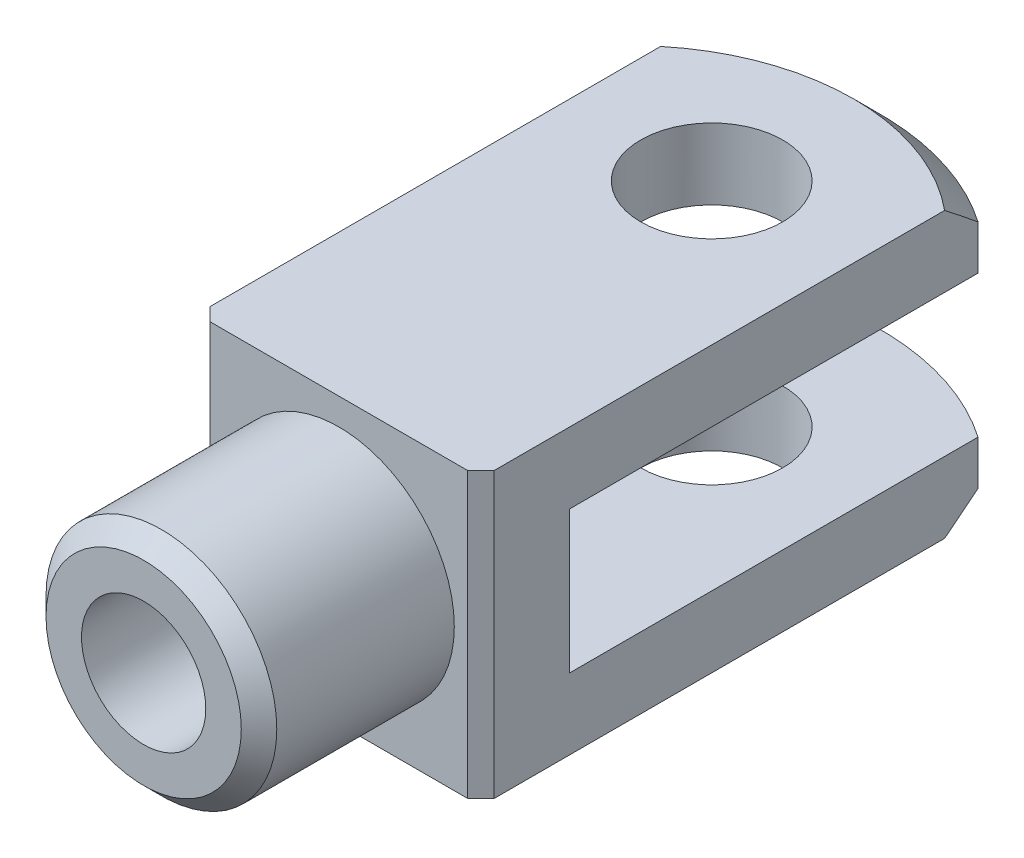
ISO-10303-21;
HEADER;
FILE_DESCRIPTION(('STEP AP214'),'2;1');
FILE_NAME('part.step','',(''),(''),'','','');
FILE_SCHEMA(('AUTOMOTIVE_DESIGN { 1 0 10303 214 1 1 1 1 }'));
ENDSEC;
DATA;
#1=APPLICATION_CONTEXT('core data for automotive mechanical design processes');
#2=APPLICATION_PROTOCOL_DEFINITION('international standard','automotive_design',2000,#1);
#3=PRODUCT_CONTEXT('',#1,'mechanical');
#4=PRODUCT('Part','Part','',(#3));
#5=PRODUCT_RELATED_PRODUCT_CATEGORY('part','',(#4));
#6=PRODUCT_DEFINITION_FORMATION('','',#4);
#7=PRODUCT_DEFINITION_CONTEXT('part definition',#1,'design');
#8=PRODUCT_DEFINITION('design','',#6,#7);
#9=PRODUCT_DEFINITION_SHAPE('','',#8);
#10=(LENGTH_UNIT() NAMED_UNIT(*) SI_UNIT(.MILLI.,.METRE.));
#11=(NAMED_UNIT(*) PLANE_ANGLE_UNIT() SI_UNIT($,.RADIAN.));
#12=(NAMED_UNIT(*) SI_UNIT($,.STERADIAN.) SOLID_ANGLE_UNIT());
#13=UNCERTAINTY_MEASURE_WITH_UNIT(LENGTH_MEASURE(1.E-05),#10,'distance_accuracy_value','');
#14=(GEOMETRIC_REPRESENTATION_CONTEXT(3) GLOBAL_UNCERTAINTY_ASSIGNED_CONTEXT((#13)) GLOBAL_UNIT_ASSIGNED_CONTEXT((#10,
#11,#12)) REPRESENTATION_CONTEXT('',''));
#15=CARTESIAN_POINT('',(0.,0.,0.));
#16=DIRECTION('',(0.,0.,1.));
#17=DIRECTION('',(1.,0.,0.));
#18=AXIS2_PLACEMENT_3D('',#15,#16,#17);
#19=CARTESIAN_POINT('',(-16.,16.,83.));
#20=DIRECTION('',(1.,0.,0.));
#21=DIRECTION('',(0.,1.,0.));
#22=AXIS2_PLACEMENT_3D('',#19,#20,#21);
#23=PLANE('',#22);
#24=DIRECTION('',(0.,0.,-1.));
#25=VECTOR('',#24,1.);
#26=CARTESIAN_POINT('',(-16.,-16.,83.));
#27=LINE('',#26,#25);
#28=CARTESIAN_POINT('',(-16.,-16.,59.5));
#29=VERTEX_POINT('',#28);
#30=CARTESIAN_POINT('',(-16.,-16.,8.76066185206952));
#31=VERTEX_POINT('',#30);
#32=EDGE_CURVE('E158',#29,#31,#27,.T.);
#33=ORIENTED_EDGE('',*,*,#32,.F.);
#34=DIRECTION('',(0.,1.,0.));
#35=VECTOR('',#34,1.);
#36=CARTESIAN_POINT('',(-16.,16.,59.5));
#37=LINE('',#36,#35);
#38=CARTESIAN_POINT('',(-16.,16.,59.5));
#39=VERTEX_POINT('',#38);
#40=EDGE_CURVE('E53',#29,#39,#37,.T.);
#41=ORIENTED_EDGE('',*,*,#40,.T.);
#42=DIRECTION('',(0.,0.,-1.));
#43=VECTOR('',#42,1.);
#44=CARTESIAN_POINT('',(-16.,16.,83.));
#45=LINE('',#44,#43);
#46=CARTESIAN_POINT('',(-16.,16.,8.76066185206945));
#47=VERTEX_POINT('',#46);
#48=EDGE_CURVE('E147',#39,#47,#45,.T.);
#49=ORIENTED_EDGE('',*,*,#48,.T.);
#50=CARTESIAN_POINT('',(-16.,16.,8.76066185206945));
#51=CARTESIAN_POINT('',(-16.,15.7552947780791,8.44307997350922));
#52=CARTESIAN_POINT('',(-16.,15.509068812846,8.12667417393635));
#53=CARTESIAN_POINT('',(-16.,15.013890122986,7.49603447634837));
#54=CARTESIAN_POINT('',(-16.,14.7649375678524,7.18180044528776));
#55=CARTESIAN_POINT('',(-16.,14.2645926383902,6.55528799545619));
#56=CARTESIAN_POINT('',(-16.,14.0132002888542,6.24300955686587));
#57=CARTESIAN_POINT('',(-16.,13.5081987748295,5.62021788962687));
#58=CARTESIAN_POINT('',(-16.,13.2545894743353,5.30970477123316));
#59=CARTESIAN_POINT('',(-16.,13.0000000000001,5.));
#60=B_SPLINE_CURVE_WITH_KNOTS('',3,(#50,#51,#52,#53,#54,#55,#56,#57,#58,#59),.UNSPECIFIED.,.F.,
.F.,(4,2,2,2,4),(0.,1.20275814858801,2.40544194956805,3.60811354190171,4.81085944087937),.UNSPECIFIED.);
#61=CARTESIAN_POINT('',(-16.,13.,5.00000000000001));
#62=VERTEX_POINT('',#61);
#63=EDGE_CURVE('E124',#47,#62,#60,.T.);
#64=ORIENTED_EDGE('',*,*,#63,.T.);
#65=DIRECTION('',(0.,-1.,0.));
#66=VECTOR('',#65,1.);
#67=CARTESIAN_POINT('',(-16.,134.169634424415,5.00000000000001));
#68=LINE('',#67,#66);
#69=CARTESIAN_POINT('',(-16.,8.00000000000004,5.00000000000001));
#70=VERTEX_POINT('',#69);
#71=EDGE_CURVE('E117',#62,#70,#68,.T.);
#72=ORIENTED_EDGE('',*,*,#71,.T.);
#73=DIRECTION('',(0.,0.,1.));
#74=VECTOR('',#73,1.);
#75=CARTESIAN_POINT('',(-16.,8.00000000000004,83.));
#76=LINE('',#75,#74);
#77=CARTESIAN_POINT('',(-16.,8.00000000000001,51.));
#78=VERTEX_POINT('',#77);
#79=EDGE_CURVE('E121',#70,#78,#76,.T.);
#80=ORIENTED_EDGE('',*,*,#79,.T.);
#81=DIRECTION('',(0.,-1.,0.));
#82=VECTOR('',#81,1.);
#83=CARTESIAN_POINT('',(-16.,16.,51.));
#84=LINE('',#83,#82);
#85=CARTESIAN_POINT('',(-16.,-8.00000000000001,51.));
#86=VERTEX_POINT('',#85);
#87=EDGE_CURVE('E144',#78,#86,#84,.T.);
#88=ORIENTED_EDGE('',*,*,#87,.T.);
#89=DIRECTION('',(0.,0.,-1.));
#90=VECTOR('',#89,1.);
#91=CARTESIAN_POINT('',(-16.,-7.99999999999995,83.));
#92=LINE('',#91,#90);
#93=CARTESIAN_POINT('',(-16.,-8.00000000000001,5.00000000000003));
#94=VERTEX_POINT('',#93);
#95=EDGE_CURVE('E145',#86,#94,#92,.T.);
#96=ORIENTED_EDGE('',*,*,#95,.T.);
#97=CARTESIAN_POINT('',(-16.,-13.,5.00000000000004));
#98=VERTEX_POINT('',#97);
#99=EDGE_CURVE('E129',#94,#98,#68,.T.);
#100=ORIENTED_EDGE('',*,*,#99,.T.);
#101=CARTESIAN_POINT('',(-16.,-13.,5.00000000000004));
#102=CARTESIAN_POINT('',(-16.,-13.2545894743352,5.30970477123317));
#103=CARTESIAN_POINT('',(-16.,-13.5081987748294,5.62021788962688));
#104=CARTESIAN_POINT('',(-16.,-14.0132002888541,6.24300955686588));
#105=CARTESIAN_POINT('',(-16.,-14.2645926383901,6.55528799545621));
#106=CARTESIAN_POINT('',(-16.,-14.7649375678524,7.18180044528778));
#107=CARTESIAN_POINT('',(-16.,-15.013890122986,7.4960344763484));
#108=CARTESIAN_POINT('',(-16.,-15.509068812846,8.12667417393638));
#109=CARTESIAN_POINT('',(-16.,-15.755294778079,8.44307997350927));
#110=CARTESIAN_POINT('',(-16.,-16.,8.76066185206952));
#111=B_SPLINE_CURVE_WITH_KNOTS('',3,(#101,#102,#103,#104,#105,#106,#107,#108,#109,#110),
.UNSPECIFIED.,.F.,.F.,(4,2,2,2,4),(0.,1.20274589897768,2.40541749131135,3.6081012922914,
4.81085944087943),.UNSPECIFIED.);
#112=EDGE_CURVE('E259',#98,#31,#111,.T.);
#113=ORIENTED_EDGE('',*,*,#112,.T.);
#114=EDGE_LOOP('',(#33,#41,#49,#64,#72,#80,#88,#96,#100,#113));
#115=FACE_BOUND('',#114,.T.);
#116=ADVANCED_FACE('F30',(#115),#23,.F.);
#117=CARTESIAN_POINT('',(-16.,-16.,83.));
#118=DIRECTION('',(0.,1.,0.));
#119=DIRECTION('',(0.,0.,1.));
#120=AXIS2_PLACEMENT_3D('',#117,#118,#119);
#121=PLANE('',#120);
#122=CARTESIAN_POINT('',(0.,-16.,19.));
#123=DIRECTION('',(0.,1.,0.));
#124=DIRECTION('',(0.,0.,1.));
#125=AXIS2_PLACEMENT_3D('',#122,#123,#124);
#126=CIRCLE('',#125,8.);
#127=CARTESIAN_POINT('',(0.,-16.,27.));
#128=VERTEX_POINT('',#127);
#129=EDGE_CURVE('E215',#128,#128,#126,.T.);
#130=ORIENTED_EDGE('',*,*,#129,.T.);
#131=EDGE_LOOP('',(#130));
#132=FACE_BOUND('',#131,.T.);
#133=DIRECTION('',(1.,0.,0.));
#134=VECTOR('',#133,1.);
#135=CARTESIAN_POINT('',(-16.,-16.,61.));
#136=LINE('',#135,#134);
#137=CARTESIAN_POINT('',(-14.5,-16.,61.));
#138=VERTEX_POINT('',#137);
#139=CARTESIAN_POINT('',(14.5,-16.,61.));
#140=VERTEX_POINT('',#139);
#141=EDGE_CURVE('E218',#138,#140,#136,.T.);
#142=ORIENTED_EDGE('',*,*,#141,.F.);
#143=DIRECTION('',(-0.707106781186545,0.,-0.70710678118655));
#144=VECTOR('',#143,1.);
#145=CARTESIAN_POINT('',(-14.5,-16.,61.));
#146=LINE('',#145,#144);
#147=EDGE_CURVE('E219',#138,#29,#146,.T.);
#148=ORIENTED_EDGE('',*,*,#147,.T.);
#149=ORIENTED_EDGE('',*,*,#32,.T.);
#150=CARTESIAN_POINT('',(0.,-16.,28.1));
#151=DIRECTION('',(0.,1.,0.));
#152=DIRECTION('',(0.,0.,1.));
#153=AXIS2_PLACEMENT_3D('',#150,#151,#152);
#154=CIRCLE('',#153,25.1);
#155=CARTESIAN_POINT('',(16.,-16.,8.76066185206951));
#156=VERTEX_POINT('',#155);
#157=EDGE_CURVE('E334',#31,#156,#154,.F.);
#158=ORIENTED_EDGE('',*,*,#157,.T.);
#159=DIRECTION('',(0.,0.,-1.));
#160=VECTOR('',#159,1.);
#161=CARTESIAN_POINT('',(16.,-16.,83.));
#162=LINE('',#161,#160);
#163=CARTESIAN_POINT('',(16.,-16.,59.5));
#164=VERTEX_POINT('',#163);
#165=EDGE_CURVE('E156',#164,#156,#162,.T.);
#166=ORIENTED_EDGE('',*,*,#165,.F.);
#167=DIRECTION('',(-0.707106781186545,0.,0.70710678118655));
#168=VECTOR('',#167,1.);
#169=CARTESIAN_POINT('',(14.5,-16.,61.));
#170=LINE('',#169,#168);
#171=EDGE_CURVE('E222',#164,#140,#170,.T.);
#172=ORIENTED_EDGE('',*,*,#171,.T.);
#173=EDGE_LOOP('',(#142,#148,#149,#158,#166,#172));
#174=FACE_BOUND('',#173,.T.);
#175=ADVANCED_FACE('F203',(#132,#174),#121,.F.);
#176=CARTESIAN_POINT('',(16.,16.,83.));
#177=DIRECTION('',(-1.,0.,0.));
#178=DIRECTION('',(0.,-1.,0.));
#179=AXIS2_PLACEMENT_3D('',#176,#177,#178);
#180=PLANE('',#179);
#181=DIRECTION('',(0.,0.,-1.));
#182=VECTOR('',#181,1.);
#183=CARTESIAN_POINT('',(16.,16.,83.));
#184=LINE('',#183,#182);
#185=CARTESIAN_POINT('',(16.,16.,59.5));
#186=VERTEX_POINT('',#185);
#187=CARTESIAN_POINT('',(16.,16.,8.76066185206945));
#188=VERTEX_POINT('',#187);
#189=EDGE_CURVE('E154',#186,#188,#184,.T.);
#190=ORIENTED_EDGE('',*,*,#189,.F.);
#191=DIRECTION('',(0.,-1.,0.));
#192=VECTOR('',#191,1.);
#193=CARTESIAN_POINT('',(16.,-16.,59.5));
#194=LINE('',#193,#192);
#195=EDGE_CURVE('E11',#186,#164,#194,.T.);
#196=ORIENTED_EDGE('',*,*,#195,.T.);
#197=ORIENTED_EDGE('',*,*,#165,.T.);
#198=CARTESIAN_POINT('',(16.,-16.,8.76066185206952));
#199=CARTESIAN_POINT('',(16.,-15.7552947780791,8.44307997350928));
#200=CARTESIAN_POINT('',(16.,-15.509068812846,8.1266741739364));
#201=CARTESIAN_POINT('',(16.,-15.013890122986,7.49603447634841));
#202=CARTESIAN_POINT('',(16.,-14.7649375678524,7.1818004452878));
#203=CARTESIAN_POINT('',(16.,-14.2645926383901,6.55528799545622));
#204=CARTESIAN_POINT('',(16.,-14.0132002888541,6.24300955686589));
#205=CARTESIAN_POINT('',(16.,-13.5081987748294,5.6202178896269));
#206=CARTESIAN_POINT('',(16.,-13.2545894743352,5.30970477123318));
#207=CARTESIAN_POINT('',(16.,-13.,5.00000000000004));
#208=B_SPLINE_CURVE_WITH_KNOTS('',3,(#198,#199,#200,#201,#202,#203,#204,#205,#206,#207),
.UNSPECIFIED.,.F.,.F.,(4,2,2,2,4),(0.,1.20275814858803,2.40544194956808,3.60811354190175,
4.81085944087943),.UNSPECIFIED.);
#209=CARTESIAN_POINT('',(16.,-13.,5.00000000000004));
#210=VERTEX_POINT('',#209);
#211=EDGE_CURVE('E182',#156,#210,#208,.T.);
#212=ORIENTED_EDGE('',*,*,#211,.T.);
#213=DIRECTION('',(0.,-1.,0.));
#214=VECTOR('',#213,1.);
#215=CARTESIAN_POINT('',(16.,134.169634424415,5.));
#216=LINE('',#215,#214);
#217=CARTESIAN_POINT('',(16.,-7.99999999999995,5.00000000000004));
#218=VERTEX_POINT('',#217);
#219=EDGE_CURVE('E128',#218,#210,#216,.T.);
#220=ORIENTED_EDGE('',*,*,#219,.F.);
#221=DIRECTION('',(0.,0.,-1.));
#222=VECTOR('',#221,1.);
#223=CARTESIAN_POINT('',(16.,-8.00000000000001,51.));
#224=LINE('',#223,#222);
#225=CARTESIAN_POINT('',(16.,-8.00000000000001,51.));
#226=VERTEX_POINT('',#225);
#227=EDGE_CURVE('E231',#226,#218,#224,.T.);
#228=ORIENTED_EDGE('',*,*,#227,.F.);
#229=DIRECTION('',(0.,-1.,0.));
#230=VECTOR('',#229,1.);
#231=CARTESIAN_POINT('',(16.,-8.00000000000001,51.));
#232=LINE('',#231,#230);
#233=CARTESIAN_POINT('',(16.,8.00000000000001,51.));
#234=VERTEX_POINT('',#233);
#235=EDGE_CURVE('E227',#234,#226,#232,.T.);
#236=ORIENTED_EDGE('',*,*,#235,.F.);
#237=DIRECTION('',(0.,0.,1.));
#238=VECTOR('',#237,1.);
#239=CARTESIAN_POINT('',(16.,8.00000000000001,51.));
#240=LINE('',#239,#238);
#241=CARTESIAN_POINT('',(16.,7.99999999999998,5.));
#242=VERTEX_POINT('',#241);
#243=EDGE_CURVE('E238',#242,#234,#240,.T.);
#244=ORIENTED_EDGE('',*,*,#243,.F.);
#245=CARTESIAN_POINT('',(16.,13.,5.));
#246=VERTEX_POINT('',#245);
#247=EDGE_CURVE('E135',#246,#242,#216,.T.);
#248=ORIENTED_EDGE('',*,*,#247,.F.);
#249=CARTESIAN_POINT('',(16.,13.,5.));
#250=CARTESIAN_POINT('',(16.,13.2545894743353,5.30970477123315));
#251=CARTESIAN_POINT('',(16.,13.5081987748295,5.62021788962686));
#252=CARTESIAN_POINT('',(16.,14.0132002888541,6.24300955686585));
#253=CARTESIAN_POINT('',(16.,14.2645926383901,6.55528799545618));
#254=CARTESIAN_POINT('',(16.,14.7649375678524,7.18180044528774));
#255=CARTESIAN_POINT('',(16.,15.013890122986,7.49603447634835));
#256=CARTESIAN_POINT('',(16.,15.509068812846,8.12667417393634));
#257=CARTESIAN_POINT('',(16.,15.755294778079,8.44307997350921));
#258=CARTESIAN_POINT('',(16.,16.,8.76066185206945));
#259=B_SPLINE_CURVE_WITH_KNOTS('',3,(#249,#250,#251,#252,#253,#254,#255,#256,#257,#258),
.UNSPECIFIED.,.F.,.F.,(4,2,2,2,4),(0.,1.20274589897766,2.40541749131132,3.60810129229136,
4.81085944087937),.UNSPECIFIED.);
#260=EDGE_CURVE('E189',#246,#188,#259,.T.);
#261=ORIENTED_EDGE('',*,*,#260,.T.);
#262=EDGE_LOOP('',(#190,#196,#197,#212,#220,#228,#236,#244,#248,#261));
#263=FACE_BOUND('',#262,.T.);
#264=ADVANCED_FACE('F198',(#263),#180,.F.);
#265=CARTESIAN_POINT('',(-16.,16.,83.));
#266=DIRECTION('',(0.,-1.,0.));
#267=DIRECTION('',(0.,0.,-1.));
#268=AXIS2_PLACEMENT_3D('',#265,#266,#267);
#269=PLANE('',#268);
#270=CARTESIAN_POINT('',(0.,16.,19.));
#271=DIRECTION('',(0.,1.,0.));
#272=DIRECTION('',(0.,0.,1.));
#273=AXIS2_PLACEMENT_3D('',#270,#271,#272);
#274=CIRCLE('',#273,8.);
#275=CARTESIAN_POINT('',(0.,16.,27.));
#276=VERTEX_POINT('',#275);
#277=EDGE_CURVE('E168',#276,#276,#274,.T.);
#278=ORIENTED_EDGE('',*,*,#277,.F.);
#279=EDGE_LOOP('',(#278));
#280=FACE_BOUND('',#279,.T.);
#281=ORIENTED_EDGE('',*,*,#48,.F.);
#282=DIRECTION('',(0.707106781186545,0.,0.70710678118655));
#283=VECTOR('',#282,1.);
#284=CARTESIAN_POINT('',(-14.5,16.,61.));
#285=LINE('',#284,#283);
#286=CARTESIAN_POINT('',(-14.5,16.,61.));
#287=VERTEX_POINT('',#286);
#288=EDGE_CURVE('E38',#39,#287,#285,.T.);
#289=ORIENTED_EDGE('',*,*,#288,.T.);
#290=DIRECTION('',(-1.,0.,0.));
#291=VECTOR('',#290,1.);
#292=CARTESIAN_POINT('',(-16.,16.,61.));
#293=LINE('',#292,#291);
#294=CARTESIAN_POINT('',(14.5,16.,61.));
#295=VERTEX_POINT('',#294);
#296=EDGE_CURVE('E160',#295,#287,#293,.T.);
#297=ORIENTED_EDGE('',*,*,#296,.F.);
#298=DIRECTION('',(0.707106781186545,0.,-0.70710678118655));
#299=VECTOR('',#298,1.);
#300=CARTESIAN_POINT('',(14.5,16.,61.));
#301=LINE('',#300,#299);
#302=EDGE_CURVE('E45',#295,#186,#301,.T.);
#303=ORIENTED_EDGE('',*,*,#302,.T.);
#304=ORIENTED_EDGE('',*,*,#189,.T.);
#305=CARTESIAN_POINT('',(0.,16.,28.1));
#306=DIRECTION('',(0.,-1.,0.));
#307=DIRECTION('',(0.,0.,-1.));
#308=AXIS2_PLACEMENT_3D('',#305,#306,#307);
#309=CIRCLE('',#308,25.1);
#310=EDGE_CURVE('E360',#188,#47,#309,.F.);
#311=ORIENTED_EDGE('',*,*,#310,.T.);
#312=EDGE_LOOP('',(#281,#289,#297,#303,#304,#311));
#313=FACE_BOUND('',#312,.T.);
#314=ADVANCED_FACE('F202',(#280,#313),#269,.F.);
#315=CARTESIAN_POINT('',(-38.,7.99999999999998,51.));
#316=DIRECTION('',(0.,1.,0.));
#317=DIRECTION('',(-1.,0.,0.));
#318=AXIS2_PLACEMENT_3D('',#315,#316,#317);
#319=PLANE('',#318);
#320=CARTESIAN_POINT('',(0.,8.00000000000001,19.));
#321=DIRECTION('',(0.,1.,0.));
#322=DIRECTION('',(-1.,0.,0.));
#323=AXIS2_PLACEMENT_3D('',#320,#321,#322);
#324=CIRCLE('',#323,8.);
#325=CARTESIAN_POINT('',(-8.,8.00000000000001,19.));
#326=VERTEX_POINT('',#325);
#327=EDGE_CURVE('E167',#326,#326,#324,.T.);
#328=ORIENTED_EDGE('',*,*,#327,.T.);
#329=EDGE_LOOP('',(#328));
#330=FACE_BOUND('',#329,.T.);
#331=CARTESIAN_POINT('',(0.,7.99999999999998,28.1));
#332=DIRECTION('',(0.,1.,0.));
#333=DIRECTION('',(-1.,0.,0.));
#334=AXIS2_PLACEMENT_3D('',#331,#332,#333);
#335=CIRCLE('',#334,28.1);
#336=EDGE_CURVE('E132',#242,#70,#335,.T.);
#337=ORIENTED_EDGE('',*,*,#336,.F.);
#338=ORIENTED_EDGE('',*,*,#243,.T.);
#339=DIRECTION('',(1.,0.,0.));
#340=VECTOR('',#339,1.);
#341=CARTESIAN_POINT('',(-38.,7.99999999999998,51.));
#342=LINE('',#341,#340);
#343=EDGE_CURVE('E143',#78,#234,#342,.T.);
#344=ORIENTED_EDGE('',*,*,#343,.F.);
#345=ORIENTED_EDGE('',*,*,#79,.F.);
#346=EDGE_LOOP('',(#337,#338,#344,#345));
#347=FACE_BOUND('',#346,.T.);
#348=ADVANCED_FACE('F141',(#330,#347),#319,.F.);
#349=CARTESIAN_POINT('',(-38.,-8.00000000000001,51.));
#350=DIRECTION('',(0.,-1.,0.));
#351=DIRECTION('',(1.,0.,0.));
#352=AXIS2_PLACEMENT_3D('',#349,#350,#351);
#353=PLANE('',#352);
#354=CARTESIAN_POINT('',(0.,-8.00000000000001,19.));
#355=DIRECTION('',(0.,-1.,0.));
#356=DIRECTION('',(1.,0.,0.));
#357=AXIS2_PLACEMENT_3D('',#354,#355,#356);
#358=CIRCLE('',#357,8.);
#359=CARTESIAN_POINT('',(8.,-8.00000000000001,19.));
#360=VERTEX_POINT('',#359);
#361=EDGE_CURVE('E164',#360,#360,#358,.T.);
#362=ORIENTED_EDGE('',*,*,#361,.T.);
#363=EDGE_LOOP('',(#362));
#364=FACE_BOUND('',#363,.T.);
#365=CARTESIAN_POINT('',(0.,-8.00000000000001,28.1));
#366=DIRECTION('',(0.,-1.,0.));
#367=DIRECTION('',(1.,0.,0.));
#368=AXIS2_PLACEMENT_3D('',#365,#366,#367);
#369=CIRCLE('',#368,28.1);
#370=EDGE_CURVE('E174',#94,#218,#369,.T.);
#371=ORIENTED_EDGE('',*,*,#370,.F.);
#372=ORIENTED_EDGE('',*,*,#95,.F.);
#373=DIRECTION('',(1.,0.,0.));
#374=VECTOR('',#373,1.);
#375=CARTESIAN_POINT('',(-38.,-8.00000000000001,51.));
#376=LINE('',#375,#374);
#377=EDGE_CURVE('E240',#86,#226,#376,.T.);
#378=ORIENTED_EDGE('',*,*,#377,.T.);
#379=ORIENTED_EDGE('',*,*,#227,.T.);
#380=EDGE_LOOP('',(#371,#372,#378,#379));
#381=FACE_BOUND('',#380,.T.);
#382=ADVANCED_FACE('F243',(#364,#381),#353,.F.);
#383=CARTESIAN_POINT('',(-38.,-8.00000000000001,51.));
#384=DIRECTION('',(0.,0.,1.));
#385=DIRECTION('',(1.,0.,0.));
#386=AXIS2_PLACEMENT_3D('',#383,#384,#385);
#387=PLANE('',#386);
#388=CARTESIAN_POINT('',(0.,0.,51.));
#389=DIRECTION('',(0.,0.,1.));
#390=DIRECTION('',(1.,0.,0.));
#391=AXIS2_PLACEMENT_3D('',#388,#389,#390);
#392=CIRCLE('',#391,6.99999999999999);
#393=CARTESIAN_POINT('',(6.99999999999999,0.,51.));
#394=VERTEX_POINT('',#393);
#395=EDGE_CURVE('E175',#394,#394,#392,.T.);
#396=ORIENTED_EDGE('',*,*,#395,.T.);
#397=EDGE_LOOP('',(#396));
#398=FACE_BOUND('',#397,.T.);
#399=ORIENTED_EDGE('',*,*,#343,.T.);
#400=ORIENTED_EDGE('',*,*,#235,.T.);
#401=ORIENTED_EDGE('',*,*,#377,.F.);
#402=ORIENTED_EDGE('',*,*,#87,.F.);
#403=EDGE_LOOP('',(#399,#400,#401,#402));
#404=FACE_BOUND('',#403,.T.);
#405=ADVANCED_FACE('F248',(#398,#404),#387,.F.);
#406=CARTESIAN_POINT('',(0.,0.,61.));
#407=DIRECTION('',(0.,0.,1.));
#408=DIRECTION('',(1.,0.,0.));
#409=AXIS2_PLACEMENT_3D('',#406,#407,#408);
#410=PLANE('',#409);
#411=CARTESIAN_POINT('',(0.,0.,61.));
#412=DIRECTION('',(0.,0.,1.));
#413=DIRECTION('',(1.,0.,0.));
#414=AXIS2_PLACEMENT_3D('',#411,#412,#413);
#415=CIRCLE('',#414,13.);
#416=CARTESIAN_POINT('',(13.,0.,61.));
#417=VERTEX_POINT('',#416);
#418=EDGE_CURVE('E228',#417,#417,#415,.T.);
#419=ORIENTED_EDGE('',*,*,#418,.F.);
#420=EDGE_LOOP('',(#419));
#421=FACE_BOUND('',#420,.T.);
#422=ORIENTED_EDGE('',*,*,#296,.T.);
#423=DIRECTION('',(0.,-1.,0.));
#424=VECTOR('',#423,1.);
#425=CARTESIAN_POINT('',(-14.5,-16.,61.));
#426=LINE('',#425,#424);
#427=EDGE_CURVE('E339',#287,#138,#426,.T.);
#428=ORIENTED_EDGE('',*,*,#427,.T.);
#429=ORIENTED_EDGE('',*,*,#141,.T.);
#430=DIRECTION('',(0.,1.,0.));
#431=VECTOR('',#430,1.);
#432=CARTESIAN_POINT('',(14.5,16.,61.));
#433=LINE('',#432,#431);
#434=EDGE_CURVE('E337',#140,#295,#433,.T.);
#435=ORIENTED_EDGE('',*,*,#434,.T.);
#436=EDGE_LOOP('',(#422,#428,#429,#435));
#437=FACE_BOUND('',#436,.T.);
#438=ADVANCED_FACE('F292',(#421,#437),#410,.T.);
#439=CARTESIAN_POINT('',(0.,0.,61.));
#440=DIRECTION('',(0.,0.,1.));
#441=DIRECTION('',(1.,0.,0.));
#442=AXIS2_PLACEMENT_3D('',#439,#440,#441);
#443=CYLINDRICAL_SURFACE('',#442,13.);
#444=CARTESIAN_POINT('',(0.,0.,81.));
#445=DIRECTION('',(0.,0.,1.));
#446=DIRECTION('',(1.,0.,0.));
#447=AXIS2_PLACEMENT_3D('',#444,#445,#446);
#448=CIRCLE('',#447,13.);
#449=CARTESIAN_POINT('',(13.,0.,81.));
#450=VERTEX_POINT('',#449);
#451=EDGE_CURVE('E171',#450,#450,#448,.F.);
#452=ORIENTED_EDGE('',*,*,#451,.T.);
#453=EDGE_LOOP('',(#452));
#454=FACE_BOUND('',#453,.T.);
#455=ORIENTED_EDGE('',*,*,#418,.T.);
#456=EDGE_LOOP('',(#455));
#457=FACE_BOUND('',#456,.T.);
#458=ADVANCED_FACE('F289',(#454,#457),#443,.T.);
#459=CARTESIAN_POINT('',(-16.,-16.,83.));
#460=DIRECTION('',(0.,0.,1.));
#461=DIRECTION('',(1.,0.,0.));
#462=AXIS2_PLACEMENT_3D('',#459,#460,#461);
#463=PLANE('',#462);
#464=CARTESIAN_POINT('',(0.,0.,83.));
#465=DIRECTION('',(0.,0.,1.));
#466=DIRECTION('',(1.,0.,0.));
#467=AXIS2_PLACEMENT_3D('',#464,#465,#466);
#468=CIRCLE('',#467,7.);
#469=CARTESIAN_POINT('',(6.99999999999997,0.,83.));
#470=VERTEX_POINT('',#469);
#471=EDGE_CURVE('E138',#470,#470,#468,.T.);
#472=ORIENTED_EDGE('',*,*,#471,.F.);
#473=EDGE_LOOP('',(#472));
#474=FACE_BOUND('',#473,.T.);
#475=CARTESIAN_POINT('',(0.,0.,83.));
#476=DIRECTION('',(0.,0.,1.));
#477=DIRECTION('',(1.,0.,0.));
#478=AXIS2_PLACEMENT_3D('',#475,#476,#477);
#479=CIRCLE('',#478,11.);
#480=CARTESIAN_POINT('',(11.,0.,83.));
#481=VERTEX_POINT('',#480);
#482=EDGE_CURVE('E163',#481,#481,#479,.T.);
#483=ORIENTED_EDGE('',*,*,#482,.T.);
#484=EDGE_LOOP('',(#483));
#485=FACE_BOUND('',#484,.T.);
#486=ADVANCED_FACE('F285',(#474,#485),#463,.T.);
#487=CARTESIAN_POINT('',(0.,-34.,19.));
#488=DIRECTION('',(0.,1.,0.));
#489=DIRECTION('',(0.,0.,1.));
#490=AXIS2_PLACEMENT_3D('',#487,#488,#489);
#491=CYLINDRICAL_SURFACE('',#490,8.);
#492=ORIENTED_EDGE('',*,*,#361,.F.);
#493=EDGE_LOOP('',(#492));
#494=FACE_BOUND('',#493,.T.);
#495=ORIENTED_EDGE('',*,*,#129,.F.);
#496=EDGE_LOOP('',(#495));
#497=FACE_BOUND('',#496,.T.);
#498=ADVANCED_FACE('F273',(#494,#497),#491,.F.);
#499=ORIENTED_EDGE('',*,*,#277,.T.);
#500=EDGE_LOOP('',(#499));
#501=FACE_BOUND('',#500,.T.);
#502=ORIENTED_EDGE('',*,*,#327,.F.);
#503=EDGE_LOOP('',(#502));
#504=FACE_BOUND('',#503,.T.);
#505=ADVANCED_FACE('F270',(#501,#504),#491,.F.);
#506=CARTESIAN_POINT('',(0.,0.,83.));
#507=DIRECTION('',(0.,0.,-1.));
#508=DIRECTION('',(-1.,0.,0.));
#509=AXIS2_PLACEMENT_3D('',#506,#507,#508);
#510=CONICAL_SURFACE('',#509,11.,0.785398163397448);
#511=ORIENTED_EDGE('',*,*,#451,.F.);
#512=EDGE_LOOP('',(#511));
#513=FACE_BOUND('',#512,.T.);
#514=ORIENTED_EDGE('',*,*,#482,.F.);
#515=EDGE_LOOP('',(#514));
#516=FACE_BOUND('',#515,.T.);
#517=ADVANCED_FACE('F272',(#513,#516),#510,.T.);
#518=CARTESIAN_POINT('',(0.,0.,83.));
#519=DIRECTION('',(0.,0.,1.));
#520=DIRECTION('',(1.,0.,0.));
#521=AXIS2_PLACEMENT_3D('',#518,#519,#520);
#522=CYLINDRICAL_SURFACE('',#521,6.99999999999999);
#523=ORIENTED_EDGE('',*,*,#471,.T.);
#524=EDGE_LOOP('',(#523));
#525=FACE_BOUND('',#524,.T.);
#526=ORIENTED_EDGE('',*,*,#395,.F.);
#527=EDGE_LOOP('',(#526));
#528=FACE_BOUND('',#527,.T.);
#529=ADVANCED_FACE('F281',(#525,#528),#522,.F.);
#530=CARTESIAN_POINT('',(0.,134.169634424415,28.1));
#531=DIRECTION('',(0.,-1.,0.));
#532=DIRECTION('',(0.,0.,-1.));
#533=AXIS2_PLACEMENT_3D('',#530,#531,#532);
#534=CYLINDRICAL_SURFACE('',#533,28.1);
#535=ORIENTED_EDGE('',*,*,#219,.T.);
#536=CARTESIAN_POINT('',(0.,-13.,28.1));
#537=DIRECTION('',(0.,1.,0.));
#538=DIRECTION('',(0.,0.,1.));
#539=AXIS2_PLACEMENT_3D('',#536,#537,#538);
#540=CIRCLE('',#539,28.1);
#541=EDGE_CURVE('E329',#210,#98,#540,.T.);
#542=ORIENTED_EDGE('',*,*,#541,.T.);
#543=ORIENTED_EDGE('',*,*,#99,.F.);
#544=ORIENTED_EDGE('',*,*,#370,.T.);
#545=EDGE_LOOP('',(#535,#542,#543,#544));
#546=FACE_BOUND('',#545,.T.);
#547=ADVANCED_FACE('F256',(#546),#534,.T.);
#548=ORIENTED_EDGE('',*,*,#71,.F.);
#549=CARTESIAN_POINT('',(0.,13.,28.1));
#550=DIRECTION('',(0.,-1.,0.));
#551=DIRECTION('',(0.,0.,-1.));
#552=AXIS2_PLACEMENT_3D('',#549,#550,#551);
#553=CIRCLE('',#552,28.1);
#554=EDGE_CURVE('E180',#62,#246,#553,.T.);
#555=ORIENTED_EDGE('',*,*,#554,.T.);
#556=ORIENTED_EDGE('',*,*,#247,.T.);
#557=ORIENTED_EDGE('',*,*,#336,.T.);
#558=EDGE_LOOP('',(#548,#555,#556,#557));
#559=FACE_BOUND('',#558,.T.);
#560=ADVANCED_FACE('F133',(#559),#534,.T.);
#561=CARTESIAN_POINT('',(0.,13.,28.1));
#562=DIRECTION('',(0.,-1.,0.));
#563=DIRECTION('',(0.,0.,-1.));
#564=AXIS2_PLACEMENT_3D('',#561,#562,#563);
#565=CONICAL_SURFACE('',#564,28.1,0.78539816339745);
#566=ORIENTED_EDGE('',*,*,#63,.F.);
#567=ORIENTED_EDGE('',*,*,#310,.F.);
#568=ORIENTED_EDGE('',*,*,#260,.F.);
#569=ORIENTED_EDGE('',*,*,#554,.F.);
#570=EDGE_LOOP('',(#566,#567,#568,#569));
#571=FACE_BOUND('',#570,.T.);
#572=ADVANCED_FACE('F318',(#571),#565,.T.);
#573=CARTESIAN_POINT('',(0.,-13.,28.1));
#574=DIRECTION('',(0.,1.,0.));
#575=DIRECTION('',(0.,0.,1.));
#576=AXIS2_PLACEMENT_3D('',#573,#574,#575);
#577=CONICAL_SURFACE('',#576,28.1,0.785398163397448);
#578=ORIENTED_EDGE('',*,*,#211,.F.);
#579=ORIENTED_EDGE('',*,*,#157,.F.);
#580=ORIENTED_EDGE('',*,*,#112,.F.);
#581=ORIENTED_EDGE('',*,*,#541,.F.);
#582=EDGE_LOOP('',(#578,#579,#580,#581));
#583=FACE_BOUND('',#582,.T.);
#584=ADVANCED_FACE('F195',(#583),#577,.T.);
#585=CARTESIAN_POINT('',(-14.5,1.11022302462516E-13,61.));
#586=DIRECTION('',(-0.70710678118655,0.,0.707106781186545));
#587=DIRECTION('',(0.707106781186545,0.,0.70710678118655));
#588=AXIS2_PLACEMENT_3D('',#585,#586,#587);
#589=PLANE('',#588);
#590=ORIENTED_EDGE('',*,*,#288,.F.);
#591=ORIENTED_EDGE('',*,*,#40,.F.);
#592=ORIENTED_EDGE('',*,*,#147,.F.);
#593=ORIENTED_EDGE('',*,*,#427,.F.);
#594=EDGE_LOOP('',(#590,#591,#592,#593));
#595=FACE_BOUND('',#594,.T.);
#596=ADVANCED_FACE('F348',(#595),#589,.T.);
#597=CARTESIAN_POINT('',(14.5,0.,61.));
#598=DIRECTION('',(0.70710678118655,0.,0.707106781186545));
#599=DIRECTION('',(0.707106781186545,0.,-0.70710678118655));
#600=AXIS2_PLACEMENT_3D('',#597,#598,#599);
#601=PLANE('',#600);
#602=ORIENTED_EDGE('',*,*,#171,.F.);
#603=ORIENTED_EDGE('',*,*,#195,.F.);
#604=ORIENTED_EDGE('',*,*,#302,.F.);
#605=ORIENTED_EDGE('',*,*,#434,.F.);
#606=EDGE_LOOP('',(#602,#603,#604,#605));
#607=FACE_BOUND('',#606,.T.);
#608=ADVANCED_FACE('F350',(#607),#601,.T.);
#609=CLOSED_SHELL('',(#116,#175,#264,#314,#348,#382,#405,#438,#458,#486,#498,#505,#517,#529,
#547,#560,#572,#584,#596,#608));
#610=MANIFOLD_SOLID_BREP('B2',#609);
#611=ADVANCED_BREP_SHAPE_REPRESENTATION('',(#18,#610),#14);
#612=SHAPE_DEFINITION_REPRESENTATION(#9,#611);
ENDSEC;
END-ISO-10303-21;
